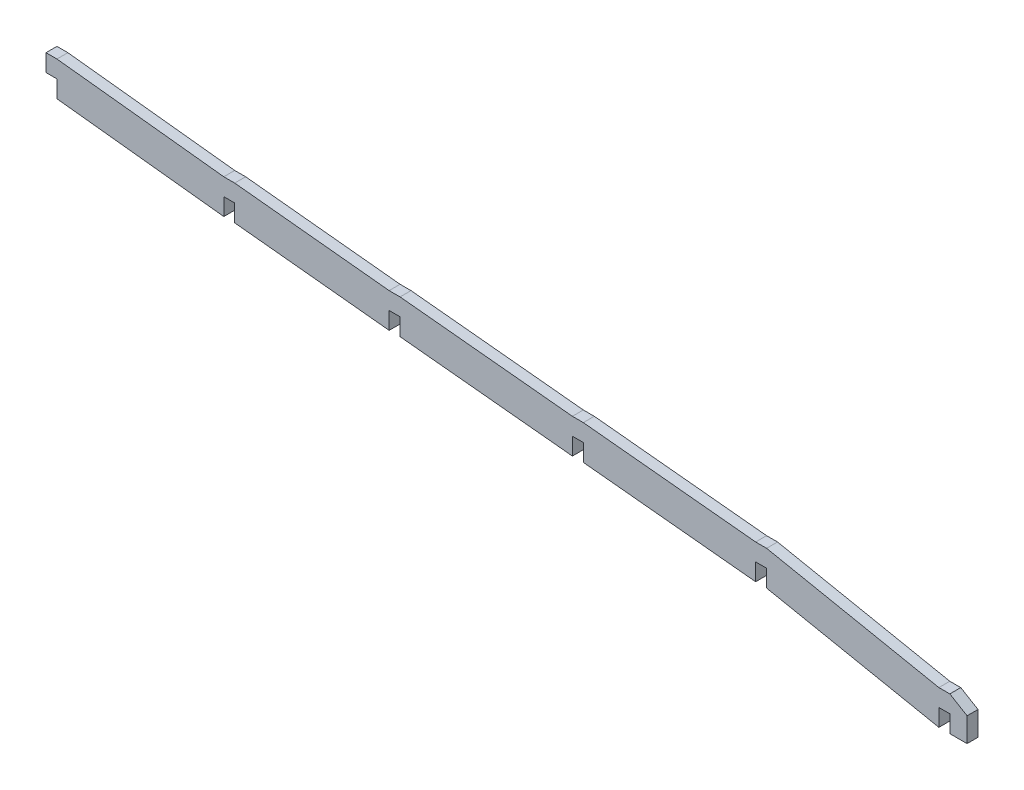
from build123d import *

# Parameters (mm, degrees)
BOSS_EXTRUDE1_DEPTH = 3.175


with BuildPart() as part:
    # Sketch1 → Boss-Extrude1 (new body)
    with BuildSketch(Plane.XY):
        Polygon((0, 45), (3.175, 45), (3.175, 40), (53.175, 35), (53.175, 40), (56.35, 40), (56.35, 35), (106.35, 30), (106.35, 35), (109.525, 35), (109.525, 30), (159.525, 20), (159.525, 25), (162.7, 25), (162.7, 20), (167.7, 20), (167.7, 27), (162.7, 30), (159.525, 30), (109.525, 40), (106.35, 40), (56.35, 45), (53.175, 45), (3.175, 50), (0, 50), (-44.81, 54.61197812), (-47.985, 54.61197812), (-96.395, 60), (-99.57, 60), (-99.57, 55), (-96.395, 55), (-96.395, 50), (-47.985, 44.61197812), (-47.985, 49.61197812), (-44.81, 49.61197812), (-44.81, 44.61197812), (0, 40), align=None)
    extrude(amount=BOSS_EXTRUDE1_DEPTH)


solid = part.part
